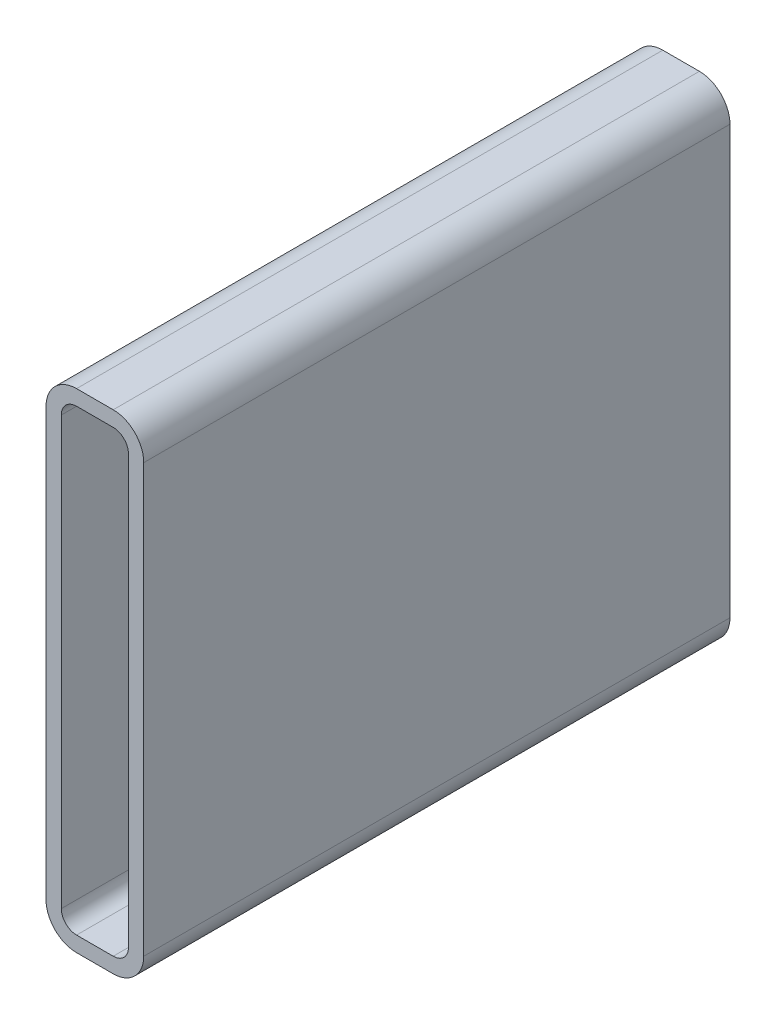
ISO-10303-21;
HEADER;
FILE_DESCRIPTION(('STEP AP214'),'2;1');
FILE_NAME('part.step','',(''),(''),'','','');
FILE_SCHEMA(('AUTOMOTIVE_DESIGN { 1 0 10303 214 1 1 1 1 }'));
ENDSEC;
DATA;
#1=APPLICATION_CONTEXT('core data for automotive mechanical design processes');
#2=APPLICATION_PROTOCOL_DEFINITION('international standard','automotive_design',2000,#1);
#3=PRODUCT_CONTEXT('',#1,'mechanical');
#4=PRODUCT('Part','Part','',(#3));
#5=PRODUCT_RELATED_PRODUCT_CATEGORY('part','',(#4));
#6=PRODUCT_DEFINITION_FORMATION('','',#4);
#7=PRODUCT_DEFINITION_CONTEXT('part definition',#1,'design');
#8=PRODUCT_DEFINITION('design','',#6,#7);
#9=PRODUCT_DEFINITION_SHAPE('','',#8);
#10=(LENGTH_UNIT() NAMED_UNIT(*) SI_UNIT(.MILLI.,.METRE.));
#11=(NAMED_UNIT(*) PLANE_ANGLE_UNIT() SI_UNIT($,.RADIAN.));
#12=(NAMED_UNIT(*) SI_UNIT($,.STERADIAN.) SOLID_ANGLE_UNIT());
#13=UNCERTAINTY_MEASURE_WITH_UNIT(LENGTH_MEASURE(1.E-05),#10,'distance_accuracy_value','');
#14=(GEOMETRIC_REPRESENTATION_CONTEXT(3) GLOBAL_UNCERTAINTY_ASSIGNED_CONTEXT((#13)) GLOBAL_UNIT_ASSIGNED_CONTEXT((#10,
#11,#12)) REPRESENTATION_CONTEXT('',''));
#15=CARTESIAN_POINT('',(0.,0.,0.));
#16=DIRECTION('',(0.,0.,1.));
#17=DIRECTION('',(1.,0.,0.));
#18=AXIS2_PLACEMENT_3D('',#15,#16,#17);
#19=CARTESIAN_POINT('',(15.875,238.125,304.8));
#20=DIRECTION('',(0.,0.,1.));
#21=DIRECTION('',(1.,0.,0.));
#22=AXIS2_PLACEMENT_3D('',#19,#20,#21);
#23=PLANE('',#22);
#24=CARTESIAN_POINT('',(15.875,238.125,304.8));
#25=DIRECTION('',(0.,0.,1.));
#26=DIRECTION('',(1.,0.,0.));
#27=AXIS2_PLACEMENT_3D('',#24,#25,#26);
#28=CIRCLE('',#27,15.875);
#29=CARTESIAN_POINT('',(15.875,254.,304.8));
#30=VERTEX_POINT('',#29);
#31=CARTESIAN_POINT('',(0.,238.125,304.8));
#32=VERTEX_POINT('',#31);
#33=EDGE_CURVE('E211',#30,#32,#28,.T.);
#34=ORIENTED_EDGE('',*,*,#33,.T.);
#35=DIRECTION('',(0.,-1.,0.));
#36=VECTOR('',#35,1.);
#37=CARTESIAN_POINT('',(0.,15.875,304.8));
#38=LINE('',#37,#36);
#39=CARTESIAN_POINT('',(0.,15.875,304.8));
#40=VERTEX_POINT('',#39);
#41=EDGE_CURVE('E214',#32,#40,#38,.T.);
#42=ORIENTED_EDGE('',*,*,#41,.T.);
#43=CARTESIAN_POINT('',(15.875,15.875,304.8));
#44=DIRECTION('',(0.,0.,1.));
#45=DIRECTION('',(1.,0.,0.));
#46=AXIS2_PLACEMENT_3D('',#43,#44,#45);
#47=CIRCLE('',#46,15.875);
#48=CARTESIAN_POINT('',(15.875,0.,304.8));
#49=VERTEX_POINT('',#48);
#50=EDGE_CURVE('E217',#40,#49,#47,.T.);
#51=ORIENTED_EDGE('',*,*,#50,.T.);
#52=DIRECTION('',(1.,0.,0.));
#53=VECTOR('',#52,1.);
#54=CARTESIAN_POINT('',(34.925,0.,304.8));
#55=LINE('',#54,#53);
#56=CARTESIAN_POINT('',(34.925,0.,304.8));
#57=VERTEX_POINT('',#56);
#58=EDGE_CURVE('E219',#49,#57,#55,.T.);
#59=ORIENTED_EDGE('',*,*,#58,.T.);
#60=CARTESIAN_POINT('',(34.925,15.875,304.8));
#61=DIRECTION('',(0.,0.,1.));
#62=DIRECTION('',(1.,0.,0.));
#63=AXIS2_PLACEMENT_3D('',#60,#61,#62);
#64=CIRCLE('',#63,15.875);
#65=CARTESIAN_POINT('',(50.8,15.875,304.8));
#66=VERTEX_POINT('',#65);
#67=EDGE_CURVE('E221',#57,#66,#64,.T.);
#68=ORIENTED_EDGE('',*,*,#67,.T.);
#69=DIRECTION('',(0.,1.,0.));
#70=VECTOR('',#69,1.);
#71=CARTESIAN_POINT('',(50.8,238.125,304.8));
#72=LINE('',#71,#70);
#73=CARTESIAN_POINT('',(50.8,238.125,304.8));
#74=VERTEX_POINT('',#73);
#75=EDGE_CURVE('E223',#66,#74,#72,.T.);
#76=ORIENTED_EDGE('',*,*,#75,.T.);
#77=CARTESIAN_POINT('',(34.925,238.125,304.8));
#78=DIRECTION('',(0.,0.,1.));
#79=DIRECTION('',(1.,0.,0.));
#80=AXIS2_PLACEMENT_3D('',#77,#78,#79);
#81=CIRCLE('',#80,15.875);
#82=CARTESIAN_POINT('',(34.925,254.,304.8));
#83=VERTEX_POINT('',#82);
#84=EDGE_CURVE('E225',#74,#83,#81,.T.);
#85=ORIENTED_EDGE('',*,*,#84,.T.);
#86=DIRECTION('',(-1.,0.,0.));
#87=VECTOR('',#86,1.);
#88=CARTESIAN_POINT('',(15.875,254.,304.8));
#89=LINE('',#88,#87);
#90=EDGE_CURVE('E227',#83,#30,#89,.T.);
#91=ORIENTED_EDGE('',*,*,#90,.T.);
#92=EDGE_LOOP('',(#34,#42,#51,#59,#68,#76,#85,#91));
#93=FACE_BOUND('',#92,.T.);
#94=DIRECTION('',(0.,-1.,0.));
#95=VECTOR('',#94,1.);
#96=CARTESIAN_POINT('',(7.9375,15.875,304.8));
#97=LINE('',#96,#95);
#98=CARTESIAN_POINT('',(7.9375,238.125,304.8));
#99=VERTEX_POINT('',#98);
#100=CARTESIAN_POINT('',(7.9375,15.875,304.8));
#101=VERTEX_POINT('',#100);
#102=EDGE_CURVE('E154',#99,#101,#97,.T.);
#103=ORIENTED_EDGE('',*,*,#102,.F.);
#104=CARTESIAN_POINT('',(15.875,238.125,304.8));
#105=DIRECTION('',(0.,0.,1.));
#106=DIRECTION('',(1.,0.,0.));
#107=AXIS2_PLACEMENT_3D('',#104,#105,#106);
#108=CIRCLE('',#107,7.93750000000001);
#109=CARTESIAN_POINT('',(15.875,246.0625,304.8));
#110=VERTEX_POINT('',#109);
#111=EDGE_CURVE('E146',#110,#99,#108,.T.);
#112=ORIENTED_EDGE('',*,*,#111,.F.);
#113=DIRECTION('',(-1.,0.,0.));
#114=VECTOR('',#113,1.);
#115=CARTESIAN_POINT('',(15.875,246.0625,304.8));
#116=LINE('',#115,#114);
#117=CARTESIAN_POINT('',(34.925,246.0625,304.8));
#118=VERTEX_POINT('',#117);
#119=EDGE_CURVE('E179',#118,#110,#116,.T.);
#120=ORIENTED_EDGE('',*,*,#119,.F.);
#121=CARTESIAN_POINT('',(34.925,238.125,304.8));
#122=DIRECTION('',(0.,0.,1.));
#123=DIRECTION('',(1.,0.,0.));
#124=AXIS2_PLACEMENT_3D('',#121,#122,#123);
#125=CIRCLE('',#124,7.93750000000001);
#126=CARTESIAN_POINT('',(42.8625,238.125,304.8));
#127=VERTEX_POINT('',#126);
#128=EDGE_CURVE('E177',#127,#118,#125,.T.);
#129=ORIENTED_EDGE('',*,*,#128,.F.);
#130=DIRECTION('',(0.,1.,0.));
#131=VECTOR('',#130,1.);
#132=CARTESIAN_POINT('',(42.8625,238.125,304.8));
#133=LINE('',#132,#131);
#134=CARTESIAN_POINT('',(42.8625,15.875,304.8));
#135=VERTEX_POINT('',#134);
#136=EDGE_CURVE('E175',#135,#127,#133,.T.);
#137=ORIENTED_EDGE('',*,*,#136,.F.);
#138=CARTESIAN_POINT('',(34.925,15.875,304.8));
#139=DIRECTION('',(0.,0.,1.));
#140=DIRECTION('',(1.,0.,0.));
#141=AXIS2_PLACEMENT_3D('',#138,#139,#140);
#142=CIRCLE('',#141,7.9375);
#143=CARTESIAN_POINT('',(34.925,7.9375,304.8));
#144=VERTEX_POINT('',#143);
#145=EDGE_CURVE('E173',#144,#135,#142,.T.);
#146=ORIENTED_EDGE('',*,*,#145,.F.);
#147=DIRECTION('',(1.,0.,0.));
#148=VECTOR('',#147,1.);
#149=CARTESIAN_POINT('',(34.925,7.9375,304.8));
#150=LINE('',#149,#148);
#151=CARTESIAN_POINT('',(15.875,7.9375,304.8));
#152=VERTEX_POINT('',#151);
#153=EDGE_CURVE('E169',#152,#144,#150,.T.);
#154=ORIENTED_EDGE('',*,*,#153,.F.);
#155=CARTESIAN_POINT('',(15.875,15.875,304.8));
#156=DIRECTION('',(0.,0.,1.));
#157=DIRECTION('',(1.,0.,0.));
#158=AXIS2_PLACEMENT_3D('',#155,#156,#157);
#159=CIRCLE('',#158,7.9375);
#160=EDGE_CURVE('E167',#101,#152,#159,.T.);
#161=ORIENTED_EDGE('',*,*,#160,.F.);
#162=EDGE_LOOP('',(#103,#112,#120,#129,#137,#146,#154,#161));
#163=FACE_BOUND('',#162,.T.);
#164=ADVANCED_FACE('F33',(#93,#163),#23,.T.);
#165=CARTESIAN_POINT('',(15.875,238.125,0.));
#166=DIRECTION('',(0.,0.,1.));
#167=DIRECTION('',(1.,0.,0.));
#168=AXIS2_PLACEMENT_3D('',#165,#166,#167);
#169=PLANE('',#168);
#170=CARTESIAN_POINT('',(15.875,238.125,0.));
#171=DIRECTION('',(0.,0.,1.));
#172=DIRECTION('',(1.,0.,0.));
#173=AXIS2_PLACEMENT_3D('',#170,#171,#172);
#174=CIRCLE('',#173,15.875);
#175=CARTESIAN_POINT('',(15.875,254.,0.));
#176=VERTEX_POINT('',#175);
#177=CARTESIAN_POINT('',(0.,238.125,0.));
#178=VERTEX_POINT('',#177);
#179=EDGE_CURVE('E162',#176,#178,#174,.T.);
#180=ORIENTED_EDGE('',*,*,#179,.F.);
#181=DIRECTION('',(-1.,0.,0.));
#182=VECTOR('',#181,1.);
#183=CARTESIAN_POINT('',(15.875,254.,0.));
#184=LINE('',#183,#182);
#185=CARTESIAN_POINT('',(34.925,254.,0.));
#186=VERTEX_POINT('',#185);
#187=EDGE_CURVE('E215',#186,#176,#184,.T.);
#188=ORIENTED_EDGE('',*,*,#187,.F.);
#189=CARTESIAN_POINT('',(34.925,238.125,0.));
#190=DIRECTION('',(0.,0.,1.));
#191=DIRECTION('',(1.,0.,0.));
#192=AXIS2_PLACEMENT_3D('',#189,#190,#191);
#193=CIRCLE('',#192,15.875);
#194=CARTESIAN_POINT('',(50.8,238.125,0.));
#195=VERTEX_POINT('',#194);
#196=EDGE_CURVE('E242',#195,#186,#193,.T.);
#197=ORIENTED_EDGE('',*,*,#196,.F.);
#198=DIRECTION('',(0.,1.,0.));
#199=VECTOR('',#198,1.);
#200=CARTESIAN_POINT('',(50.8,238.125,0.));
#201=LINE('',#200,#199);
#202=CARTESIAN_POINT('',(50.8,15.875,0.));
#203=VERTEX_POINT('',#202);
#204=EDGE_CURVE('E240',#203,#195,#201,.T.);
#205=ORIENTED_EDGE('',*,*,#204,.F.);
#206=CARTESIAN_POINT('',(34.925,15.875,0.));
#207=DIRECTION('',(0.,0.,1.));
#208=DIRECTION('',(1.,0.,0.));
#209=AXIS2_PLACEMENT_3D('',#206,#207,#208);
#210=CIRCLE('',#209,15.875);
#211=CARTESIAN_POINT('',(34.925,0.,0.));
#212=VERTEX_POINT('',#211);
#213=EDGE_CURVE('E238',#212,#203,#210,.T.);
#214=ORIENTED_EDGE('',*,*,#213,.F.);
#215=DIRECTION('',(1.,0.,0.));
#216=VECTOR('',#215,1.);
#217=CARTESIAN_POINT('',(34.925,0.,0.));
#218=LINE('',#217,#216);
#219=CARTESIAN_POINT('',(15.875,0.,0.));
#220=VERTEX_POINT('',#219);
#221=EDGE_CURVE('E236',#220,#212,#218,.T.);
#222=ORIENTED_EDGE('',*,*,#221,.F.);
#223=CARTESIAN_POINT('',(15.875,15.875,0.));
#224=DIRECTION('',(0.,0.,1.));
#225=DIRECTION('',(1.,0.,0.));
#226=AXIS2_PLACEMENT_3D('',#223,#224,#225);
#227=CIRCLE('',#226,15.875);
#228=CARTESIAN_POINT('',(0.,15.875,0.));
#229=VERTEX_POINT('',#228);
#230=EDGE_CURVE('E234',#229,#220,#227,.T.);
#231=ORIENTED_EDGE('',*,*,#230,.F.);
#232=DIRECTION('',(0.,-1.,0.));
#233=VECTOR('',#232,1.);
#234=CARTESIAN_POINT('',(0.,15.875,0.));
#235=LINE('',#234,#233);
#236=EDGE_CURVE('E232',#178,#229,#235,.T.);
#237=ORIENTED_EDGE('',*,*,#236,.F.);
#238=EDGE_LOOP('',(#180,#188,#197,#205,#214,#222,#231,#237));
#239=FACE_BOUND('',#238,.T.);
#240=CARTESIAN_POINT('',(15.875,238.125,0.));
#241=DIRECTION('',(0.,0.,1.));
#242=DIRECTION('',(1.,0.,0.));
#243=AXIS2_PLACEMENT_3D('',#240,#241,#242);
#244=CIRCLE('',#243,7.93750000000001);
#245=CARTESIAN_POINT('',(15.875,246.0625,0.));
#246=VERTEX_POINT('',#245);
#247=CARTESIAN_POINT('',(7.9375,238.125,0.));
#248=VERTEX_POINT('',#247);
#249=EDGE_CURVE('E56',#246,#248,#244,.T.);
#250=ORIENTED_EDGE('',*,*,#249,.T.);
#251=DIRECTION('',(0.,-1.,0.));
#252=VECTOR('',#251,1.);
#253=CARTESIAN_POINT('',(7.9375,15.875,0.));
#254=LINE('',#253,#252);
#255=CARTESIAN_POINT('',(7.9375,15.875,0.));
#256=VERTEX_POINT('',#255);
#257=EDGE_CURVE('E161',#248,#256,#254,.T.);
#258=ORIENTED_EDGE('',*,*,#257,.T.);
#259=CARTESIAN_POINT('',(15.875,15.875,0.));
#260=DIRECTION('',(0.,0.,1.));
#261=DIRECTION('',(1.,0.,0.));
#262=AXIS2_PLACEMENT_3D('',#259,#260,#261);
#263=CIRCLE('',#262,7.9375);
#264=CARTESIAN_POINT('',(15.875,7.9375,0.));
#265=VERTEX_POINT('',#264);
#266=EDGE_CURVE('E183',#256,#265,#263,.T.);
#267=ORIENTED_EDGE('',*,*,#266,.T.);
#268=DIRECTION('',(1.,0.,0.));
#269=VECTOR('',#268,1.);
#270=CARTESIAN_POINT('',(34.925,7.9375,0.));
#271=LINE('',#270,#269);
#272=CARTESIAN_POINT('',(34.925,7.9375,0.));
#273=VERTEX_POINT('',#272);
#274=EDGE_CURVE('E186',#265,#273,#271,.T.);
#275=ORIENTED_EDGE('',*,*,#274,.T.);
#276=CARTESIAN_POINT('',(34.925,15.875,0.));
#277=DIRECTION('',(0.,0.,1.));
#278=DIRECTION('',(1.,0.,0.));
#279=AXIS2_PLACEMENT_3D('',#276,#277,#278);
#280=CIRCLE('',#279,7.9375);
#281=CARTESIAN_POINT('',(42.8625,15.875,0.));
#282=VERTEX_POINT('',#281);
#283=EDGE_CURVE('E189',#273,#282,#280,.T.);
#284=ORIENTED_EDGE('',*,*,#283,.T.);
#285=DIRECTION('',(0.,1.,0.));
#286=VECTOR('',#285,1.);
#287=CARTESIAN_POINT('',(42.8625,238.125,0.));
#288=LINE('',#287,#286);
#289=CARTESIAN_POINT('',(42.8625,238.125,0.));
#290=VERTEX_POINT('',#289);
#291=EDGE_CURVE('E192',#282,#290,#288,.T.);
#292=ORIENTED_EDGE('',*,*,#291,.T.);
#293=CARTESIAN_POINT('',(34.925,238.125,0.));
#294=DIRECTION('',(0.,0.,1.));
#295=DIRECTION('',(1.,0.,0.));
#296=AXIS2_PLACEMENT_3D('',#293,#294,#295);
#297=CIRCLE('',#296,7.93750000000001);
#298=CARTESIAN_POINT('',(34.925,246.0625,0.));
#299=VERTEX_POINT('',#298);
#300=EDGE_CURVE('E195',#290,#299,#297,.T.);
#301=ORIENTED_EDGE('',*,*,#300,.T.);
#302=DIRECTION('',(-1.,0.,0.));
#303=VECTOR('',#302,1.);
#304=CARTESIAN_POINT('',(15.875,246.0625,0.));
#305=LINE('',#304,#303);
#306=EDGE_CURVE('E155',#299,#246,#305,.T.);
#307=ORIENTED_EDGE('',*,*,#306,.T.);
#308=EDGE_LOOP('',(#250,#258,#267,#275,#284,#292,#301,#307));
#309=FACE_BOUND('',#308,.T.);
#310=ADVANCED_FACE('F272',(#239,#309),#169,.F.);
#311=CARTESIAN_POINT('',(15.875,238.125,304.8));
#312=DIRECTION('',(0.,0.,-1.));
#313=DIRECTION('',(-1.,0.,0.));
#314=AXIS2_PLACEMENT_3D('',#311,#312,#313);
#315=CYLINDRICAL_SURFACE('',#314,15.875);
#316=ORIENTED_EDGE('',*,*,#179,.T.);
#317=DIRECTION('',(0.,0.,-1.));
#318=VECTOR('',#317,1.);
#319=CARTESIAN_POINT('',(0.,238.125,304.8));
#320=LINE('',#319,#318);
#321=EDGE_CURVE('E11',#32,#178,#320,.T.);
#322=ORIENTED_EDGE('',*,*,#321,.F.);
#323=ORIENTED_EDGE('',*,*,#33,.F.);
#324=DIRECTION('',(0.,0.,-1.));
#325=VECTOR('',#324,1.);
#326=CARTESIAN_POINT('',(15.875,254.,304.8));
#327=LINE('',#326,#325);
#328=EDGE_CURVE('E229',#30,#176,#327,.T.);
#329=ORIENTED_EDGE('',*,*,#328,.T.);
#330=EDGE_LOOP('',(#316,#322,#323,#329));
#331=FACE_BOUND('',#330,.T.);
#332=ADVANCED_FACE('F35',(#331),#315,.T.);
#333=CARTESIAN_POINT('',(0.,15.875,304.8));
#334=DIRECTION('',(1.,0.,0.));
#335=DIRECTION('',(0.,0.,-1.));
#336=AXIS2_PLACEMENT_3D('',#333,#334,#335);
#337=PLANE('',#336);
#338=ORIENTED_EDGE('',*,*,#236,.T.);
#339=DIRECTION('',(0.,0.,-1.));
#340=VECTOR('',#339,1.);
#341=CARTESIAN_POINT('',(0.,15.875,304.8));
#342=LINE('',#341,#340);
#343=EDGE_CURVE('E41',#40,#229,#342,.T.);
#344=ORIENTED_EDGE('',*,*,#343,.F.);
#345=ORIENTED_EDGE('',*,*,#41,.F.);
#346=ORIENTED_EDGE('',*,*,#321,.T.);
#347=EDGE_LOOP('',(#338,#344,#345,#346));
#348=FACE_BOUND('',#347,.T.);
#349=ADVANCED_FACE('F289',(#348),#337,.F.);
#350=CARTESIAN_POINT('',(15.875,15.875,304.8));
#351=DIRECTION('',(0.,0.,-1.));
#352=DIRECTION('',(-1.,0.,0.));
#353=AXIS2_PLACEMENT_3D('',#350,#351,#352);
#354=CYLINDRICAL_SURFACE('',#353,15.875);
#355=ORIENTED_EDGE('',*,*,#230,.T.);
#356=DIRECTION('',(0.,0.,-1.));
#357=VECTOR('',#356,1.);
#358=CARTESIAN_POINT('',(15.875,0.,304.8));
#359=LINE('',#358,#357);
#360=EDGE_CURVE('E259',#49,#220,#359,.T.);
#361=ORIENTED_EDGE('',*,*,#360,.F.);
#362=ORIENTED_EDGE('',*,*,#50,.F.);
#363=ORIENTED_EDGE('',*,*,#343,.T.);
#364=EDGE_LOOP('',(#355,#361,#362,#363));
#365=FACE_BOUND('',#364,.T.);
#366=ADVANCED_FACE('F266',(#365),#354,.T.);
#367=CARTESIAN_POINT('',(34.925,0.,304.8));
#368=DIRECTION('',(0.,1.,0.));
#369=DIRECTION('',(0.,0.,1.));
#370=AXIS2_PLACEMENT_3D('',#367,#368,#369);
#371=PLANE('',#370);
#372=ORIENTED_EDGE('',*,*,#221,.T.);
#373=DIRECTION('',(0.,0.,-1.));
#374=VECTOR('',#373,1.);
#375=CARTESIAN_POINT('',(34.925,0.,304.8));
#376=LINE('',#375,#374);
#377=EDGE_CURVE('E256',#57,#212,#376,.T.);
#378=ORIENTED_EDGE('',*,*,#377,.F.);
#379=ORIENTED_EDGE('',*,*,#58,.F.);
#380=ORIENTED_EDGE('',*,*,#360,.T.);
#381=EDGE_LOOP('',(#372,#378,#379,#380));
#382=FACE_BOUND('',#381,.T.);
#383=ADVANCED_FACE('F278',(#382),#371,.F.);
#384=CARTESIAN_POINT('',(34.925,15.875,304.8));
#385=DIRECTION('',(0.,0.,-1.));
#386=DIRECTION('',(-1.,0.,0.));
#387=AXIS2_PLACEMENT_3D('',#384,#385,#386);
#388=CYLINDRICAL_SURFACE('',#387,15.875);
#389=ORIENTED_EDGE('',*,*,#213,.T.);
#390=DIRECTION('',(0.,0.,-1.));
#391=VECTOR('',#390,1.);
#392=CARTESIAN_POINT('',(50.8,15.875,304.8));
#393=LINE('',#392,#391);
#394=EDGE_CURVE('E253',#66,#203,#393,.T.);
#395=ORIENTED_EDGE('',*,*,#394,.F.);
#396=ORIENTED_EDGE('',*,*,#67,.F.);
#397=ORIENTED_EDGE('',*,*,#377,.T.);
#398=EDGE_LOOP('',(#389,#395,#396,#397));
#399=FACE_BOUND('',#398,.T.);
#400=ADVANCED_FACE('F282',(#399),#388,.T.);
#401=CARTESIAN_POINT('',(50.8,238.125,304.8));
#402=DIRECTION('',(-1.,0.,0.));
#403=DIRECTION('',(0.,0.,1.));
#404=AXIS2_PLACEMENT_3D('',#401,#402,#403);
#405=PLANE('',#404);
#406=ORIENTED_EDGE('',*,*,#204,.T.);
#407=DIRECTION('',(0.,0.,-1.));
#408=VECTOR('',#407,1.);
#409=CARTESIAN_POINT('',(50.8,238.125,304.8));
#410=LINE('',#409,#408);
#411=EDGE_CURVE('E250',#74,#195,#410,.T.);
#412=ORIENTED_EDGE('',*,*,#411,.F.);
#413=ORIENTED_EDGE('',*,*,#75,.F.);
#414=ORIENTED_EDGE('',*,*,#394,.T.);
#415=EDGE_LOOP('',(#406,#412,#413,#414));
#416=FACE_BOUND('',#415,.T.);
#417=ADVANCED_FACE('F302',(#416),#405,.F.);
#418=CARTESIAN_POINT('',(34.925,238.125,304.8));
#419=DIRECTION('',(0.,0.,-1.));
#420=DIRECTION('',(-1.,0.,0.));
#421=AXIS2_PLACEMENT_3D('',#418,#419,#420);
#422=CYLINDRICAL_SURFACE('',#421,15.875);
#423=ORIENTED_EDGE('',*,*,#196,.T.);
#424=DIRECTION('',(0.,0.,-1.));
#425=VECTOR('',#424,1.);
#426=CARTESIAN_POINT('',(34.925,254.,304.8));
#427=LINE('',#426,#425);
#428=EDGE_CURVE('E247',#83,#186,#427,.T.);
#429=ORIENTED_EDGE('',*,*,#428,.F.);
#430=ORIENTED_EDGE('',*,*,#84,.F.);
#431=ORIENTED_EDGE('',*,*,#411,.T.);
#432=EDGE_LOOP('',(#423,#429,#430,#431));
#433=FACE_BOUND('',#432,.T.);
#434=ADVANCED_FACE('F300',(#433),#422,.T.);
#435=CARTESIAN_POINT('',(15.875,254.,304.8));
#436=DIRECTION('',(0.,-1.,0.));
#437=DIRECTION('',(0.,0.,-1.));
#438=AXIS2_PLACEMENT_3D('',#435,#436,#437);
#439=PLANE('',#438);
#440=ORIENTED_EDGE('',*,*,#187,.T.);
#441=ORIENTED_EDGE('',*,*,#328,.F.);
#442=ORIENTED_EDGE('',*,*,#90,.F.);
#443=ORIENTED_EDGE('',*,*,#428,.T.);
#444=EDGE_LOOP('',(#440,#441,#442,#443));
#445=FACE_BOUND('',#444,.T.);
#446=ADVANCED_FACE('F295',(#445),#439,.F.);
#447=CARTESIAN_POINT('',(15.875,238.125,304.8));
#448=DIRECTION('',(0.,0.,-1.));
#449=DIRECTION('',(-1.,0.,0.));
#450=AXIS2_PLACEMENT_3D('',#447,#448,#449);
#451=CYLINDRICAL_SURFACE('',#450,7.93750000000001);
#452=ORIENTED_EDGE('',*,*,#249,.F.);
#453=DIRECTION('',(0.,0.,-1.));
#454=VECTOR('',#453,1.);
#455=CARTESIAN_POINT('',(15.875,246.0625,304.8));
#456=LINE('',#455,#454);
#457=EDGE_CURVE('E150',#110,#246,#456,.T.);
#458=ORIENTED_EDGE('',*,*,#457,.F.);
#459=ORIENTED_EDGE('',*,*,#111,.T.);
#460=DIRECTION('',(0.,0.,-1.));
#461=VECTOR('',#460,1.);
#462=CARTESIAN_POINT('',(7.9375,238.125,304.8));
#463=LINE('',#462,#461);
#464=EDGE_CURVE('E149',#99,#248,#463,.T.);
#465=ORIENTED_EDGE('',*,*,#464,.T.);
#466=EDGE_LOOP('',(#452,#458,#459,#465));
#467=FACE_BOUND('',#466,.T.);
#468=ADVANCED_FACE('F148',(#467),#451,.F.);
#469=CARTESIAN_POINT('',(7.9375,15.875,304.8));
#470=DIRECTION('',(1.,0.,0.));
#471=DIRECTION('',(0.,0.,-1.));
#472=AXIS2_PLACEMENT_3D('',#469,#470,#471);
#473=PLANE('',#472);
#474=ORIENTED_EDGE('',*,*,#257,.F.);
#475=ORIENTED_EDGE('',*,*,#464,.F.);
#476=ORIENTED_EDGE('',*,*,#102,.T.);
#477=DIRECTION('',(0.,0.,-1.));
#478=VECTOR('',#477,1.);
#479=CARTESIAN_POINT('',(7.9375,15.875,304.8));
#480=LINE('',#479,#478);
#481=EDGE_CURVE('E163',#101,#256,#480,.T.);
#482=ORIENTED_EDGE('',*,*,#481,.T.);
#483=EDGE_LOOP('',(#474,#475,#476,#482));
#484=FACE_BOUND('',#483,.T.);
#485=ADVANCED_FACE('F158',(#484),#473,.T.);
#486=CARTESIAN_POINT('',(15.875,15.875,304.8));
#487=DIRECTION('',(0.,0.,-1.));
#488=DIRECTION('',(-1.,0.,0.));
#489=AXIS2_PLACEMENT_3D('',#486,#487,#488);
#490=CYLINDRICAL_SURFACE('',#489,7.9375);
#491=ORIENTED_EDGE('',*,*,#266,.F.);
#492=ORIENTED_EDGE('',*,*,#481,.F.);
#493=ORIENTED_EDGE('',*,*,#160,.T.);
#494=DIRECTION('',(0.,0.,-1.));
#495=VECTOR('',#494,1.);
#496=CARTESIAN_POINT('',(15.875,7.9375,304.8));
#497=LINE('',#496,#495);
#498=EDGE_CURVE('E208',#152,#265,#497,.T.);
#499=ORIENTED_EDGE('',*,*,#498,.T.);
#500=EDGE_LOOP('',(#491,#492,#493,#499));
#501=FACE_BOUND('',#500,.T.);
#502=ADVANCED_FACE('F327',(#501),#490,.F.);
#503=CARTESIAN_POINT('',(34.925,7.9375,304.8));
#504=DIRECTION('',(0.,1.,0.));
#505=DIRECTION('',(0.,0.,1.));
#506=AXIS2_PLACEMENT_3D('',#503,#504,#505);
#507=PLANE('',#506);
#508=ORIENTED_EDGE('',*,*,#274,.F.);
#509=ORIENTED_EDGE('',*,*,#498,.F.);
#510=ORIENTED_EDGE('',*,*,#153,.T.);
#511=DIRECTION('',(0.,0.,-1.));
#512=VECTOR('',#511,1.);
#513=CARTESIAN_POINT('',(34.925,7.9375,304.8));
#514=LINE('',#513,#512);
#515=EDGE_CURVE('E206',#144,#273,#514,.T.);
#516=ORIENTED_EDGE('',*,*,#515,.T.);
#517=EDGE_LOOP('',(#508,#509,#510,#516));
#518=FACE_BOUND('',#517,.T.);
#519=ADVANCED_FACE('F331',(#518),#507,.T.);
#520=CARTESIAN_POINT('',(34.925,15.875,304.8));
#521=DIRECTION('',(0.,0.,-1.));
#522=DIRECTION('',(-1.,0.,0.));
#523=AXIS2_PLACEMENT_3D('',#520,#521,#522);
#524=CYLINDRICAL_SURFACE('',#523,7.9375);
#525=ORIENTED_EDGE('',*,*,#283,.F.);
#526=ORIENTED_EDGE('',*,*,#515,.F.);
#527=ORIENTED_EDGE('',*,*,#145,.T.);
#528=DIRECTION('',(0.,0.,-1.));
#529=VECTOR('',#528,1.);
#530=CARTESIAN_POINT('',(42.8625,15.875,304.8));
#531=LINE('',#530,#529);
#532=EDGE_CURVE('E204',#135,#282,#531,.T.);
#533=ORIENTED_EDGE('',*,*,#532,.T.);
#534=EDGE_LOOP('',(#525,#526,#527,#533));
#535=FACE_BOUND('',#534,.T.);
#536=ADVANCED_FACE('F337',(#535),#524,.F.);
#537=CARTESIAN_POINT('',(42.8625,238.125,304.8));
#538=DIRECTION('',(-1.,0.,0.));
#539=DIRECTION('',(0.,0.,1.));
#540=AXIS2_PLACEMENT_3D('',#537,#538,#539);
#541=PLANE('',#540);
#542=ORIENTED_EDGE('',*,*,#291,.F.);
#543=ORIENTED_EDGE('',*,*,#532,.F.);
#544=ORIENTED_EDGE('',*,*,#136,.T.);
#545=DIRECTION('',(0.,0.,-1.));
#546=VECTOR('',#545,1.);
#547=CARTESIAN_POINT('',(42.8625,238.125,304.8));
#548=LINE('',#547,#546);
#549=EDGE_CURVE('E202',#127,#290,#548,.T.);
#550=ORIENTED_EDGE('',*,*,#549,.T.);
#551=EDGE_LOOP('',(#542,#543,#544,#550));
#552=FACE_BOUND('',#551,.T.);
#553=ADVANCED_FACE('F341',(#552),#541,.T.);
#554=CARTESIAN_POINT('',(34.925,238.125,304.8));
#555=DIRECTION('',(0.,0.,-1.));
#556=DIRECTION('',(-1.,0.,0.));
#557=AXIS2_PLACEMENT_3D('',#554,#555,#556);
#558=CYLINDRICAL_SURFACE('',#557,7.93750000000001);
#559=ORIENTED_EDGE('',*,*,#300,.F.);
#560=ORIENTED_EDGE('',*,*,#549,.F.);
#561=ORIENTED_EDGE('',*,*,#128,.T.);
#562=DIRECTION('',(0.,0.,-1.));
#563=VECTOR('',#562,1.);
#564=CARTESIAN_POINT('',(34.925,246.0625,304.8));
#565=LINE('',#564,#563);
#566=EDGE_CURVE('E48',#118,#299,#565,.T.);
#567=ORIENTED_EDGE('',*,*,#566,.T.);
#568=EDGE_LOOP('',(#559,#560,#561,#567));
#569=FACE_BOUND('',#568,.T.);
#570=ADVANCED_FACE('F345',(#569),#558,.F.);
#571=CARTESIAN_POINT('',(15.875,246.0625,304.8));
#572=DIRECTION('',(0.,-1.,0.));
#573=DIRECTION('',(0.,0.,-1.));
#574=AXIS2_PLACEMENT_3D('',#571,#572,#573);
#575=PLANE('',#574);
#576=ORIENTED_EDGE('',*,*,#306,.F.);
#577=ORIENTED_EDGE('',*,*,#566,.F.);
#578=ORIENTED_EDGE('',*,*,#119,.T.);
#579=ORIENTED_EDGE('',*,*,#457,.T.);
#580=EDGE_LOOP('',(#576,#577,#578,#579));
#581=FACE_BOUND('',#580,.T.);
#582=ADVANCED_FACE('F349',(#581),#575,.T.);
#583=CLOSED_SHELL('',(#164,#310,#332,#349,#366,#383,#400,#417,#434,#446,#468,#485,#502,#519,
#536,#553,#570,#582));
#584=MANIFOLD_SOLID_BREP('B2',#583);
#585=ADVANCED_BREP_SHAPE_REPRESENTATION('',(#18,#584),#14);
#586=SHAPE_DEFINITION_REPRESENTATION(#9,#585);
ENDSEC;
END-ISO-10303-21;
